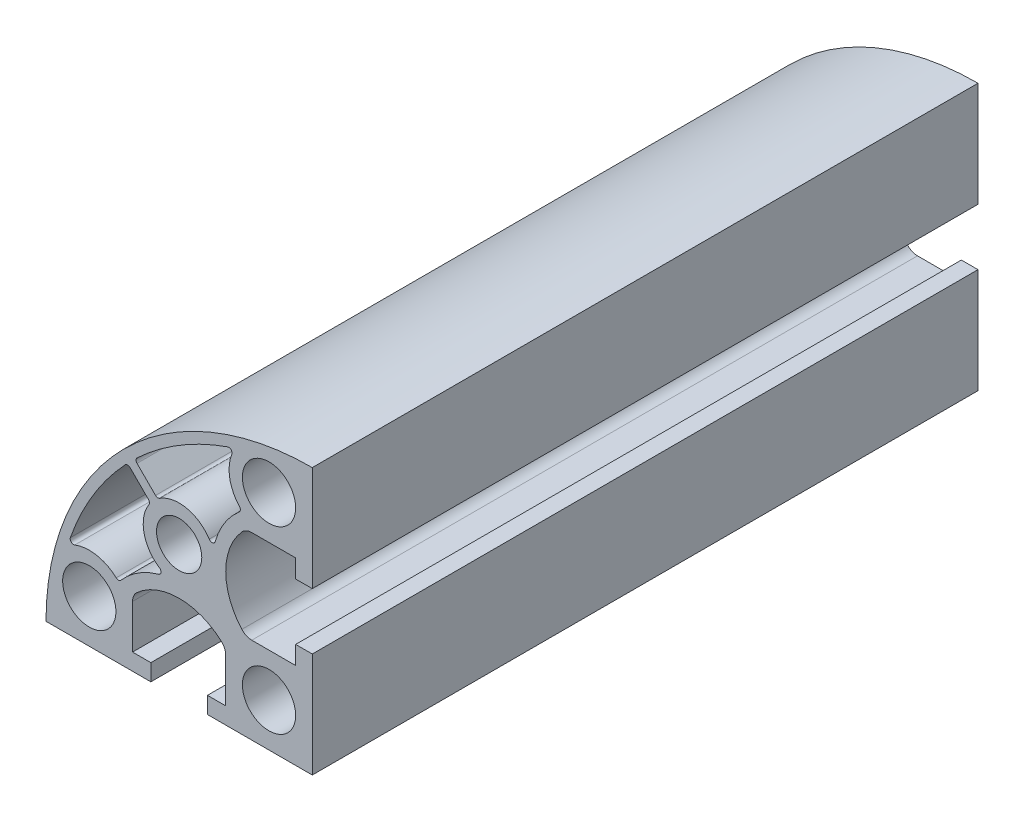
from build123d import *
from build123d.topology import SkipClean

# Parameters (mm, degrees)
SKETCH_1_W               = 40
SKETCH_1_H               = 40
EXTRUDE_1_DEPTH          = 50
SKETCH_2_R               = 3.4
CUT_EXTRUDE_1_DEPTH      = 104.923048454
SKETCH_3_R               = 4
CUT_EXTRUDE_2_DEPTH      = 104.923048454
PATTERN_CIRCULAR_1_COUNT = 4
CUT_EXTRUDE_3_DEPTH      = 104.923048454
PATTERN_CIRCULAR_2_COUNT = 4
CUT_EXTRUDE_4_DEPTH      = 104.923048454
PATTERN_CIRCULAR_3_COUNT = 4
CUT_EXTRUDE_6_DEPTH      = 104.923048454
EXTRUDE_2_DEPTH          = 100
CUT_EXTRUDE_7_DEPTH      = 104.923048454


with BuildPart() as part:
    # Sketch 1 → Extrude 1 (new, symmetric)
    with BuildSketch(Plane.XY):
        Rectangle(SKETCH_1_W, SKETCH_1_H)
    extrude(amount=EXTRUDE_1_DEPTH, both=True)

    # Sketch 2 → Cut-Extrude 1 (cut, through all)
    with BuildSketch(Plane.XY.offset(50)):
        Circle(SKETCH_2_R)
    extrude(amount=-CUT_EXTRUDE_1_DEPTH, mode=Mode.SUBTRACT)

    # Sketch 3 → Cut-Extrude 2 (cut, through all)
    with BuildSketch(Plane.XY.offset(50)):
        with Locations((-13.5, 13.5)):
            Circle(SKETCH_3_R)
    cut_extrude_2 = extrude(amount=-CUT_EXTRUDE_2_DEPTH, mode=Mode.SUBTRACT)

    # Pattern Circular 1: Cut-Extrude 2 ×4 about axis
    pattern_circular_1_axis = Axis((0, 0, 0), (0, 0, 1))
    for i in range(1, PATTERN_CIRCULAR_1_COUNT):
        add(cut_extrude_2.rotate(pattern_circular_1_axis, i * 360 / PATTERN_CIRCULAR_1_COUNT), mode=Mode.SUBTRACT)

    # Sketch 4 → Cut-Extrude 3 (cut, through all)
    with BuildSketch(Plane.XY.offset(50)):
        with BuildLine():
            Line((4.25, 20), (-4.25, 20))
            Line((-4.25, 20), (-4.25, 17.5))
            Line((-4.25, 17.5), (-7, 17.5))
            Line((-7, 17.5), (-7, 10.909830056))
            ThreePointArc((-7, 10.909830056), (-6.825741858, 10.093333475), (-6.333333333, 9.419118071))
            ThreePointArc((-6.333333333, 9.419118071), (0, 7), (6.333333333, 9.419118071))
            ThreePointArc((6.333333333, 9.419118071), (6.825741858, 10.093333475), (7, 10.909830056))
            Line((7, 10.909830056), (7, 17.5))
            Line((7, 17.5), (4.25, 17.5))
            Line((4.25, 17.5), (4.25, 20))
        make_face()
    cut_extrude_3 = extrude(amount=-CUT_EXTRUDE_3_DEPTH, mode=Mode.SUBTRACT)

    # Pattern Circular 2: Cut-Extrude 3 ×4 about axis
    pattern_circular_2_axis = Axis((0, 0, 0), (0, 0, 1))
    for i in range(1, PATTERN_CIRCULAR_2_COUNT):
        add(cut_extrude_3.rotate(pattern_circular_2_axis, i * 360 / PATTERN_CIRCULAR_2_COUNT), mode=Mode.SUBTRACT)

    # Sketch 5 → Cut-Extrude 4 (cut, through all)
    with BuildSketch(Plane.XY.offset(50)):
        with BuildLine():
            Line((-15.74793376, 16.808593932), (-17.179034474, 18.239694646))
            ThreePointArc((-17.179034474, 18.239694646), (-18.239694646, 18.239694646), (-18.239694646, 17.179034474))
            Line((-18.239694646, 17.179034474), (-16.808593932, 15.74793376))
            ThreePointArc((-16.808593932, 15.74793376), (-16.328427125, 16.328427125), (-15.74793376, 16.808593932))
        make_face()
    cut_extrude_4 = extrude(amount=-CUT_EXTRUDE_4_DEPTH, mode=Mode.SUBTRACT)

    # Pattern Circular 3: Cut-Extrude 4 ×4 about axis
    pattern_circular_3_axis = Axis((-13.5, 13.5, 0), (0, 0, 1))
    for i in range(1, PATTERN_CIRCULAR_3_COUNT):
        add(cut_extrude_4.rotate(pattern_circular_3_axis, i * 360 / PATTERN_CIRCULAR_3_COUNT), mode=Mode.SUBTRACT)

    # Sketch 7 → Cut-Extrude 6 (cut, through all)
    with BuildSketch(Plane.XY.offset(50)):
        with BuildLine():
            Line((20, 20), (-20, 20))
            Line((-20, 20), (-20, -20))
            ThreePointArc((-20, -20), (-8.284271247, 8.284271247), (20, 20))
        make_face()
    extrude(amount=-CUT_EXTRUDE_6_DEPTH, mode=Mode.SUBTRACT)

    # Sketch 8 → Extrude 2 (add)
    with SkipClean():  # the faces are left unmerged after this step: merging them gives an invalid solid
        with BuildSketch(Plane.XY.offset(50)):
            with BuildLine():
                Line((7, 16.238791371), (7, 17.828560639))
                ThreePointArc((7, 17.828560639), (-8.284271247, 8.284271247), (-17.828560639, -7))
                Line((-17.828560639, -7), (-16.238791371, -7))
                ThreePointArc((-16.238791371, -7), (-7.223611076, 7.223611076), (7, 16.238791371))
            make_face()
        extrude(amount=-EXTRUDE_2_DEPTH)

    # Sketch 9 → Cut-Extrude 7 (cut, through all)
    with SkipClean():  # the faces are left unmerged after this step: merging them gives an invalid solid
        with BuildSketch(Plane.XY.offset(50)):
            with BuildLine():
                Line((-3.546893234, 4.607553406), (-6.325186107, 7.385846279))
                ThreePointArc((-6.325186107, 7.385846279), (-6.471565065, 7.747624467), (-6.313364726, 8.104391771))
                ThreePointArc((-6.313364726, 8.104391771), (0.054245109, 12.930485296), (7.280879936, 16.338326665))
                ThreePointArc((7.280879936, 16.338326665), (7.805911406, 16.213544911), (7.91175075, 15.684369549))
                ThreePointArc((7.91175075, 15.684369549), (7.600808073, 12.404767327), (9.068222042, 9.455331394))
                ThreePointArc((9.068222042, 9.455331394), (9.197956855, 9.087462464), (9.023952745, 8.738347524))
                ThreePointArc((9.023952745, 8.738347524), (6.802975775, 6.182048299), (5.422828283, 3.089703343))
                ThreePointArc((5.422828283, 3.089703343), (5.017439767, 2.729883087), (4.522465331, 2.950814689))
                ThreePointArc((4.522465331, 2.950814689), (1.127701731, 5.280936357), (-2.922717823, 4.540674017))
                ThreePointArc((-2.922717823, 4.540674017), (-3.246609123, 4.463952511), (-3.546893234, 4.607553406))
            make_face()
            with BuildLine():
                Line((-4.607553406, 3.546893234), (-7.385846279, 6.325186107))
                ThreePointArc((-7.385846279, 6.325186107), (-7.747624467, 6.471565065), (-8.104391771, 6.313364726))
                ThreePointArc((-8.104391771, 6.313364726), (-12.930485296, -0.054245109), (-16.338326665, -7.280879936))
                ThreePointArc((-16.338326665, -7.280879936), (-16.213544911, -7.805911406), (-15.684369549, -7.91175075))
                ThreePointArc((-15.684369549, -7.91175075), (-12.404767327, -7.600808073), (-9.455331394, -9.068222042))
                ThreePointArc((-9.455331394, -9.068222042), (-9.087462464, -9.197956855), (-8.738347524, -9.023952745))
                ThreePointArc((-8.738347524, -9.023952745), (-6.182048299, -6.802975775), (-3.089703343, -5.422828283))
                ThreePointArc((-3.089703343, -5.422828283), (-2.729883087, -5.017439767), (-2.950814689, -4.522465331))
                ThreePointArc((-2.950814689, -4.522465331), (-5.280936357, -1.127701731), (-4.540674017, 2.922717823))
                ThreePointArc((-4.540674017, 2.922717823), (-4.463952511, 3.246609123), (-4.607553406, 3.546893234))
            make_face()
        extrude(amount=-CUT_EXTRUDE_7_DEPTH, mode=Mode.SUBTRACT)


solid = part.part
